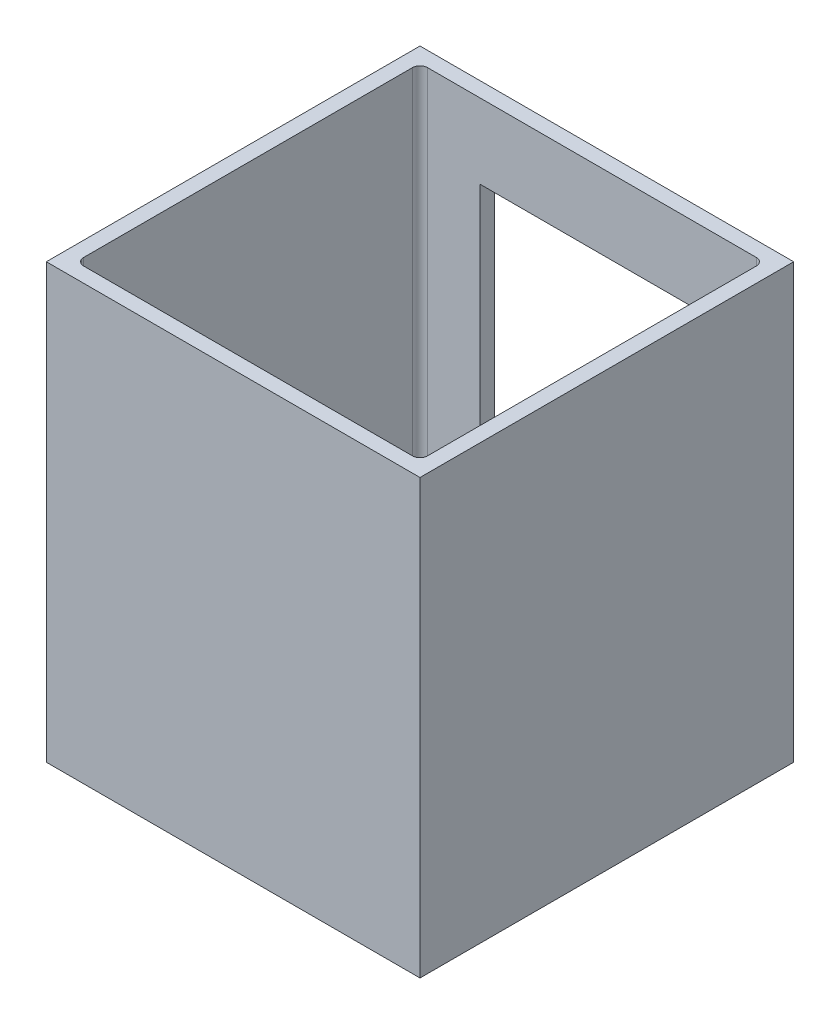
ISO-10303-21;
HEADER;
FILE_DESCRIPTION(('STEP AP214'),'2;1');
FILE_NAME('part.step','',(''),(''),'','','');
FILE_SCHEMA(('AUTOMOTIVE_DESIGN { 1 0 10303 214 1 1 1 1 }'));
ENDSEC;
DATA;
#1=APPLICATION_CONTEXT('core data for automotive mechanical design processes');
#2=APPLICATION_PROTOCOL_DEFINITION('international standard','automotive_design',2000,#1);
#3=PRODUCT_CONTEXT('',#1,'mechanical');
#4=PRODUCT('Part','Part','',(#3));
#5=PRODUCT_RELATED_PRODUCT_CATEGORY('part','',(#4));
#6=PRODUCT_DEFINITION_FORMATION('','',#4);
#7=PRODUCT_DEFINITION_CONTEXT('part definition',#1,'design');
#8=PRODUCT_DEFINITION('design','',#6,#7);
#9=PRODUCT_DEFINITION_SHAPE('','',#8);
#10=(LENGTH_UNIT() NAMED_UNIT(*) SI_UNIT(.MILLI.,.METRE.));
#11=(NAMED_UNIT(*) PLANE_ANGLE_UNIT() SI_UNIT($,.RADIAN.));
#12=(NAMED_UNIT(*) SI_UNIT($,.STERADIAN.) SOLID_ANGLE_UNIT());
#13=UNCERTAINTY_MEASURE_WITH_UNIT(LENGTH_MEASURE(1.E-05),#10,'distance_accuracy_value','');
#14=(GEOMETRIC_REPRESENTATION_CONTEXT(3) GLOBAL_UNCERTAINTY_ASSIGNED_CONTEXT((#13)) GLOBAL_UNIT_ASSIGNED_CONTEXT((#10,
#11,#12)) REPRESENTATION_CONTEXT('',''));
#15=CARTESIAN_POINT('',(0.,0.,0.));
#16=DIRECTION('',(0.,0.,1.));
#17=DIRECTION('',(1.,0.,0.));
#18=AXIS2_PLACEMENT_3D('',#15,#16,#17);
#19=CARTESIAN_POINT('',(2.54,-302.26,0.));
#20=DIRECTION('',(1.,0.,0.));
#21=DIRECTION('',(0.,0.,-1.));
#22=AXIS2_PLACEMENT_3D('',#19,#20,#21);
#23=PLANE('',#22);
#24=DIRECTION('',(0.,0.,1.));
#25=VECTOR('',#24,1.);
#26=CARTESIAN_POINT('',(2.54,-76.2,0.));
#27=LINE('',#26,#25);
#28=CARTESIAN_POINT('',(2.54,-76.2,-55.88));
#29=VERTEX_POINT('',#28);
#30=CARTESIAN_POINT('',(2.54,-76.2,-7.62));
#31=VERTEX_POINT('',#30);
#32=EDGE_CURVE('E434',#29,#31,#27,.T.);
#33=ORIENTED_EDGE('',*,*,#32,.F.);
#34=DIRECTION('',(0.,-1.,0.));
#35=VECTOR('',#34,1.);
#36=CARTESIAN_POINT('',(2.54,-72.39,-55.88));
#37=LINE('',#36,#35);
#38=CARTESIAN_POINT('',(2.54,-72.39,-55.88));
#39=VERTEX_POINT('',#38);
#40=EDGE_CURVE('E280',#39,#29,#37,.T.);
#41=ORIENTED_EDGE('',*,*,#40,.F.);
#42=DIRECTION('',(0.,0.,1.));
#43=VECTOR('',#42,1.);
#44=CARTESIAN_POINT('',(2.54,-72.39,0.));
#45=LINE('',#44,#43);
#46=CARTESIAN_POINT('',(2.54,-72.39,-59.69));
#47=VERTEX_POINT('',#46);
#48=EDGE_CURVE('E267',#47,#39,#45,.T.);
#49=ORIENTED_EDGE('',*,*,#48,.F.);
#50=DIRECTION('',(0.,1.,0.));
#51=VECTOR('',#50,1.);
#52=CARTESIAN_POINT('',(2.54,-2.53999999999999,-59.69));
#53=LINE('',#52,#51);
#54=CARTESIAN_POINT('',(2.54,-2.53999999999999,-59.69));
#55=VERTEX_POINT('',#54);
#56=EDGE_CURVE('E529',#47,#55,#53,.T.);
#57=ORIENTED_EDGE('',*,*,#56,.T.);
#58=DIRECTION('',(0.,0.,-1.));
#59=VECTOR('',#58,1.);
#60=CARTESIAN_POINT('',(2.54,-2.53999999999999,0.));
#61=LINE('',#60,#59);
#62=CARTESIAN_POINT('',(2.54,-2.53999999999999,-3.81));
#63=VERTEX_POINT('',#62);
#64=EDGE_CURVE('E498',#63,#55,#61,.T.);
#65=ORIENTED_EDGE('',*,*,#64,.F.);
#66=DIRECTION('',(0.,1.,0.));
#67=VECTOR('',#66,1.);
#68=CARTESIAN_POINT('',(2.54,-302.26,-3.81));
#69=LINE('',#68,#67);
#70=CARTESIAN_POINT('',(2.54,-72.39,-3.81));
#71=VERTEX_POINT('',#70);
#72=EDGE_CURVE('E532',#63,#71,#69,.F.);
#73=ORIENTED_EDGE('',*,*,#72,.T.);
#74=DIRECTION('',(0.,0.,1.));
#75=VECTOR('',#74,1.);
#76=CARTESIAN_POINT('',(2.54,-72.39,0.));
#77=LINE('',#76,#75);
#78=CARTESIAN_POINT('',(2.54,-72.39,-7.62));
#79=VERTEX_POINT('',#78);
#80=EDGE_CURVE('E386',#79,#71,#77,.T.);
#81=ORIENTED_EDGE('',*,*,#80,.F.);
#82=DIRECTION('',(0.,-1.,0.));
#83=VECTOR('',#82,1.);
#84=CARTESIAN_POINT('',(2.54,-72.39,-7.62));
#85=LINE('',#84,#83);
#86=EDGE_CURVE('E409',#79,#31,#85,.T.);
#87=ORIENTED_EDGE('',*,*,#86,.T.);
#88=EDGE_LOOP('',(#33,#41,#49,#57,#65,#73,#81,#87));
#89=FACE_BOUND('',#88,.T.);
#90=ADVANCED_FACE('F45',(#89),#23,.T.);
#91=CARTESIAN_POINT('',(3.81,-302.26,-59.69));
#92=DIRECTION('',(0.,-1.,0.));
#93=DIRECTION('',(0.,0.,-1.));
#94=AXIS2_PLACEMENT_3D('',#91,#92,#93);
#95=CYLINDRICAL_SURFACE('',#94,1.27);
#96=CARTESIAN_POINT('',(3.81,-72.39,-59.69));
#97=DIRECTION('',(0.,-1.,0.));
#98=DIRECTION('',(0.,0.,-1.));
#99=AXIS2_PLACEMENT_3D('',#96,#97,#98);
#100=CIRCLE('',#99,1.27);
#101=CARTESIAN_POINT('',(3.81,-72.39,-60.96));
#102=VERTEX_POINT('',#101);
#103=EDGE_CURVE('E242',#102,#47,#100,.F.);
#104=ORIENTED_EDGE('',*,*,#103,.F.);
#105=DIRECTION('',(0.,1.,0.));
#106=VECTOR('',#105,1.);
#107=CARTESIAN_POINT('',(3.81,-302.26,-60.96));
#108=LINE('',#107,#106);
#109=CARTESIAN_POINT('',(3.81,-2.53999999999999,-60.96));
#110=VERTEX_POINT('',#109);
#111=EDGE_CURVE('E257',#110,#102,#108,.F.);
#112=ORIENTED_EDGE('',*,*,#111,.F.);
#113=CARTESIAN_POINT('',(3.81,-2.53999999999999,-59.69));
#114=DIRECTION('',(0.,-1.,0.));
#115=DIRECTION('',(0.,0.,-1.));
#116=AXIS2_PLACEMENT_3D('',#113,#114,#115);
#117=CIRCLE('',#116,1.27);
#118=EDGE_CURVE('E551',#55,#110,#117,.T.);
#119=ORIENTED_EDGE('',*,*,#118,.F.);
#120=ORIENTED_EDGE('',*,*,#56,.F.);
#121=EDGE_LOOP('',(#104,#112,#119,#120));
#122=FACE_BOUND('',#121,.T.);
#123=ADVANCED_FACE('F670',(#122),#95,.F.);
#124=CARTESIAN_POINT('',(0.,-302.26,-60.96));
#125=DIRECTION('',(0.,0.,1.));
#126=DIRECTION('',(1.,0.,0.));
#127=AXIS2_PLACEMENT_3D('',#124,#125,#126);
#128=PLANE('',#127);
#129=DIRECTION('',(0.,-1.,0.));
#130=VECTOR('',#129,1.);
#131=CARTESIAN_POINT('',(7.62,-72.39,-60.96));
#132=LINE('',#131,#130);
#133=CARTESIAN_POINT('',(7.62,-72.39,-60.96));
#134=VERTEX_POINT('',#133);
#135=CARTESIAN_POINT('',(7.62,-76.2,-60.96));
#136=VERTEX_POINT('',#135);
#137=EDGE_CURVE('E231',#134,#136,#132,.T.);
#138=ORIENTED_EDGE('',*,*,#137,.T.);
#139=DIRECTION('',(-1.,0.,0.));
#140=VECTOR('',#139,1.);
#141=CARTESIAN_POINT('',(0.,-76.2,-60.96));
#142=LINE('',#141,#140);
#143=CARTESIAN_POINT('',(12.7,-76.2,-60.96));
#144=VERTEX_POINT('',#143);
#145=EDGE_CURVE('E441',#144,#136,#142,.T.);
#146=ORIENTED_EDGE('',*,*,#145,.F.);
#147=DIRECTION('',(0.,-1.,0.));
#148=VECTOR('',#147,1.);
#149=CARTESIAN_POINT('',(12.7,0.,-60.96));
#150=LINE('',#149,#148);
#151=CARTESIAN_POINT('',(12.7,-15.24,-60.96));
#152=VERTEX_POINT('',#151);
#153=EDGE_CURVE('E458',#152,#144,#150,.T.);
#154=ORIENTED_EDGE('',*,*,#153,.F.);
#155=DIRECTION('',(1.,0.,0.));
#156=VECTOR('',#155,1.);
#157=CARTESIAN_POINT('',(0.,-15.24,-60.96));
#158=LINE('',#157,#156);
#159=CARTESIAN_POINT('',(50.8,-15.24,-60.96));
#160=VERTEX_POINT('',#159);
#161=EDGE_CURVE('E449',#152,#160,#158,.T.);
#162=ORIENTED_EDGE('',*,*,#161,.T.);
#163=DIRECTION('',(0.,-1.,0.));
#164=VECTOR('',#163,1.);
#165=CARTESIAN_POINT('',(50.8,0.,-60.96));
#166=LINE('',#165,#164);
#167=CARTESIAN_POINT('',(50.8,-76.2,-60.96));
#168=VERTEX_POINT('',#167);
#169=EDGE_CURVE('E453',#160,#168,#166,.T.);
#170=ORIENTED_EDGE('',*,*,#169,.T.);
#171=CARTESIAN_POINT('',(55.88,-76.2,-60.96));
#172=VERTEX_POINT('',#171);
#173=EDGE_CURVE('E437',#172,#168,#142,.T.);
#174=ORIENTED_EDGE('',*,*,#173,.F.);
#175=DIRECTION('',(0.,-1.,0.));
#176=VECTOR('',#175,1.);
#177=CARTESIAN_POINT('',(55.88,-72.39,-60.96));
#178=LINE('',#177,#176);
#179=CARTESIAN_POINT('',(55.88,-72.39,-60.96));
#180=VERTEX_POINT('',#179);
#181=EDGE_CURVE('E307',#180,#172,#178,.T.);
#182=ORIENTED_EDGE('',*,*,#181,.F.);
#183=DIRECTION('',(-1.,0.,0.));
#184=VECTOR('',#183,1.);
#185=CARTESIAN_POINT('',(0.,-72.39,-60.96));
#186=LINE('',#185,#184);
#187=CARTESIAN_POINT('',(59.69,-72.39,-60.96));
#188=VERTEX_POINT('',#187);
#189=EDGE_CURVE('E294',#188,#180,#186,.T.);
#190=ORIENTED_EDGE('',*,*,#189,.F.);
#191=DIRECTION('',(0.,1.,0.));
#192=VECTOR('',#191,1.);
#193=CARTESIAN_POINT('',(59.69,-302.26,-60.96));
#194=LINE('',#193,#192);
#195=CARTESIAN_POINT('',(59.69,-2.53999999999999,-60.96));
#196=VERTEX_POINT('',#195);
#197=EDGE_CURVE('E536',#188,#196,#194,.T.);
#198=ORIENTED_EDGE('',*,*,#197,.T.);
#199=DIRECTION('',(1.,0.,0.));
#200=VECTOR('',#199,1.);
#201=CARTESIAN_POINT('',(0.,-2.53999999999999,-60.96));
#202=LINE('',#201,#200);
#203=EDGE_CURVE('E494',#110,#196,#202,.T.);
#204=ORIENTED_EDGE('',*,*,#203,.F.);
#205=ORIENTED_EDGE('',*,*,#111,.T.);
#206=DIRECTION('',(-1.,0.,0.));
#207=VECTOR('',#206,1.);
#208=CARTESIAN_POINT('',(0.,-72.39,-60.96));
#209=LINE('',#208,#207);
#210=EDGE_CURVE('E246',#134,#102,#209,.T.);
#211=ORIENTED_EDGE('',*,*,#210,.F.);
#212=EDGE_LOOP('',(#138,#146,#154,#162,#170,#174,#182,#190,#198,#204,#205,#211));
#213=FACE_BOUND('',#212,.T.);
#214=ADVANCED_FACE('F254',(#213),#128,.T.);
#215=CARTESIAN_POINT('',(59.69,-302.26,-59.69));
#216=DIRECTION('',(0.,1.,0.));
#217=DIRECTION('',(0.,0.,1.));
#218=AXIS2_PLACEMENT_3D('',#215,#216,#217);
#219=CYLINDRICAL_SURFACE('',#218,1.27);
#220=CARTESIAN_POINT('',(59.69,-72.39,-59.69));
#221=DIRECTION('',(0.,-1.,0.));
#222=DIRECTION('',(0.,0.,-1.));
#223=AXIS2_PLACEMENT_3D('',#220,#221,#222);
#224=CIRCLE('',#223,1.27);
#225=CARTESIAN_POINT('',(60.96,-72.39,-59.69));
#226=VERTEX_POINT('',#225);
#227=EDGE_CURVE('E297',#226,#188,#224,.F.);
#228=ORIENTED_EDGE('',*,*,#227,.F.);
#229=DIRECTION('',(0.,1.,0.));
#230=VECTOR('',#229,1.);
#231=CARTESIAN_POINT('',(60.96,-302.26,-59.69));
#232=LINE('',#231,#230);
#233=CARTESIAN_POINT('',(60.96,-2.53999999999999,-59.69));
#234=VERTEX_POINT('',#233);
#235=EDGE_CURVE('E544',#234,#226,#232,.F.);
#236=ORIENTED_EDGE('',*,*,#235,.F.);
#237=CARTESIAN_POINT('',(59.69,-2.53999999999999,-59.69));
#238=DIRECTION('',(0.,-1.,0.));
#239=DIRECTION('',(0.,0.,-1.));
#240=AXIS2_PLACEMENT_3D('',#237,#238,#239);
#241=CIRCLE('',#240,1.27);
#242=EDGE_CURVE('E54',#196,#234,#241,.T.);
#243=ORIENTED_EDGE('',*,*,#242,.F.);
#244=ORIENTED_EDGE('',*,*,#197,.F.);
#245=EDGE_LOOP('',(#228,#236,#243,#244));
#246=FACE_BOUND('',#245,.T.);
#247=ADVANCED_FACE('F568',(#246),#219,.F.);
#248=CARTESIAN_POINT('',(60.96,-302.26,0.));
#249=DIRECTION('',(1.,0.,0.));
#250=DIRECTION('',(0.,0.,-1.));
#251=AXIS2_PLACEMENT_3D('',#248,#249,#250);
#252=PLANE('',#251);
#253=DIRECTION('',(0.,0.,-1.));
#254=VECTOR('',#253,1.);
#255=CARTESIAN_POINT('',(60.96,-72.39,0.));
#256=LINE('',#255,#254);
#257=CARTESIAN_POINT('',(60.96,-72.39,-55.88));
#258=VERTEX_POINT('',#257);
#259=EDGE_CURVE('E300',#258,#226,#256,.T.);
#260=ORIENTED_EDGE('',*,*,#259,.F.);
#261=DIRECTION('',(0.,-1.,0.));
#262=VECTOR('',#261,1.);
#263=CARTESIAN_POINT('',(60.96,-72.39,-55.88));
#264=LINE('',#263,#262);
#265=CARTESIAN_POINT('',(60.96,-76.2,-55.88));
#266=VERTEX_POINT('',#265);
#267=EDGE_CURVE('E319',#258,#266,#264,.T.);
#268=ORIENTED_EDGE('',*,*,#267,.T.);
#269=DIRECTION('',(0.,0.,1.));
#270=VECTOR('',#269,1.);
#271=CARTESIAN_POINT('',(60.96,-76.2,0.));
#272=LINE('',#271,#270);
#273=CARTESIAN_POINT('',(60.96,-76.2,-7.62));
#274=VERTEX_POINT('',#273);
#275=EDGE_CURVE('E428',#266,#274,#272,.T.);
#276=ORIENTED_EDGE('',*,*,#275,.T.);
#277=DIRECTION('',(0.,-1.,0.));
#278=VECTOR('',#277,1.);
#279=CARTESIAN_POINT('',(60.96,-72.39,-7.62));
#280=LINE('',#279,#278);
#281=CARTESIAN_POINT('',(60.96,-72.39,-7.62));
#282=VERTEX_POINT('',#281);
#283=EDGE_CURVE('E360',#282,#274,#280,.T.);
#284=ORIENTED_EDGE('',*,*,#283,.F.);
#285=DIRECTION('',(0.,0.,-1.));
#286=VECTOR('',#285,1.);
#287=CARTESIAN_POINT('',(60.96,-72.39,0.));
#288=LINE('',#287,#286);
#289=CARTESIAN_POINT('',(60.96,-72.39,-3.81));
#290=VERTEX_POINT('',#289);
#291=EDGE_CURVE('E341',#290,#282,#288,.T.);
#292=ORIENTED_EDGE('',*,*,#291,.F.);
#293=DIRECTION('',(0.,1.,0.));
#294=VECTOR('',#293,1.);
#295=CARTESIAN_POINT('',(60.96,-2.53999999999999,-3.81));
#296=LINE('',#295,#294);
#297=CARTESIAN_POINT('',(60.96,-2.53999999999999,-3.81));
#298=VERTEX_POINT('',#297);
#299=EDGE_CURVE('E541',#290,#298,#296,.T.);
#300=ORIENTED_EDGE('',*,*,#299,.T.);
#301=DIRECTION('',(0.,0.,-1.));
#302=VECTOR('',#301,1.);
#303=CARTESIAN_POINT('',(60.96,-2.53999999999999,0.));
#304=LINE('',#303,#302);
#305=EDGE_CURVE('E510',#298,#234,#304,.T.);
#306=ORIENTED_EDGE('',*,*,#305,.T.);
#307=ORIENTED_EDGE('',*,*,#235,.T.);
#308=EDGE_LOOP('',(#260,#268,#276,#284,#292,#300,#306,#307));
#309=FACE_BOUND('',#308,.T.);
#310=ADVANCED_FACE('F564',(#309),#252,.F.);
#311=CARTESIAN_POINT('',(59.69,-302.26,-3.81));
#312=DIRECTION('',(0.,-1.,0.));
#313=DIRECTION('',(0.,0.,-1.));
#314=AXIS2_PLACEMENT_3D('',#311,#312,#313);
#315=CYLINDRICAL_SURFACE('',#314,1.27);
#316=CARTESIAN_POINT('',(59.69,-72.39,-3.81));
#317=DIRECTION('',(0.,-1.,0.));
#318=DIRECTION('',(0.,0.,-1.));
#319=AXIS2_PLACEMENT_3D('',#316,#317,#318);
#320=CIRCLE('',#319,1.27);
#321=CARTESIAN_POINT('',(59.69,-72.39,-2.54));
#322=VERTEX_POINT('',#321);
#323=EDGE_CURVE('E345',#322,#290,#320,.F.);
#324=ORIENTED_EDGE('',*,*,#323,.F.);
#325=DIRECTION('',(0.,1.,0.));
#326=VECTOR('',#325,1.);
#327=CARTESIAN_POINT('',(59.69,-302.26,-2.54));
#328=LINE('',#327,#326);
#329=CARTESIAN_POINT('',(59.69,-2.53999999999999,-2.54));
#330=VERTEX_POINT('',#329);
#331=EDGE_CURVE('E522',#330,#322,#328,.F.);
#332=ORIENTED_EDGE('',*,*,#331,.F.);
#333=CARTESIAN_POINT('',(59.69,-2.53999999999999,-3.81));
#334=DIRECTION('',(0.,-1.,0.));
#335=DIRECTION('',(0.,0.,-1.));
#336=AXIS2_PLACEMENT_3D('',#333,#334,#335);
#337=CIRCLE('',#336,1.27);
#338=EDGE_CURVE('E11',#298,#330,#337,.T.);
#339=ORIENTED_EDGE('',*,*,#338,.F.);
#340=ORIENTED_EDGE('',*,*,#299,.F.);
#341=EDGE_LOOP('',(#324,#332,#339,#340));
#342=FACE_BOUND('',#341,.T.);
#343=ADVANCED_FACE('F47',(#342),#315,.F.);
#344=CARTESIAN_POINT('',(0.,-302.26,-2.54));
#345=DIRECTION('',(0.,0.,1.));
#346=DIRECTION('',(1.,0.,0.));
#347=AXIS2_PLACEMENT_3D('',#344,#345,#346);
#348=PLANE('',#347);
#349=DIRECTION('',(1.,0.,0.));
#350=VECTOR('',#349,1.);
#351=CARTESIAN_POINT('',(0.,-72.39,-2.54));
#352=LINE('',#351,#350);
#353=CARTESIAN_POINT('',(55.88,-72.39,-2.54));
#354=VERTEX_POINT('',#353);
#355=EDGE_CURVE('E329',#354,#322,#352,.T.);
#356=ORIENTED_EDGE('',*,*,#355,.F.);
#357=DIRECTION('',(0.,-1.,0.));
#358=VECTOR('',#357,1.);
#359=CARTESIAN_POINT('',(55.88,-72.39,-2.54));
#360=LINE('',#359,#358);
#361=CARTESIAN_POINT('',(55.88,-76.2,-2.54));
#362=VERTEX_POINT('',#361);
#363=EDGE_CURVE('E349',#354,#362,#360,.T.);
#364=ORIENTED_EDGE('',*,*,#363,.T.);
#365=DIRECTION('',(-1.,0.,0.));
#366=VECTOR('',#365,1.);
#367=CARTESIAN_POINT('',(0.,-76.2,-2.54));
#368=LINE('',#367,#366);
#369=CARTESIAN_POINT('',(7.62,-76.2,-2.54));
#370=VERTEX_POINT('',#369);
#371=EDGE_CURVE('E431',#362,#370,#368,.T.);
#372=ORIENTED_EDGE('',*,*,#371,.T.);
#373=DIRECTION('',(0.,-1.,0.));
#374=VECTOR('',#373,1.);
#375=CARTESIAN_POINT('',(7.62,-72.39,-2.54));
#376=LINE('',#375,#374);
#377=CARTESIAN_POINT('',(7.62,-72.39,-2.54));
#378=VERTEX_POINT('',#377);
#379=EDGE_CURVE('E394',#378,#370,#376,.T.);
#380=ORIENTED_EDGE('',*,*,#379,.F.);
#381=DIRECTION('',(1.,0.,0.));
#382=VECTOR('',#381,1.);
#383=CARTESIAN_POINT('',(0.,-72.39,-2.54));
#384=LINE('',#383,#382);
#385=CARTESIAN_POINT('',(3.81,-72.39,-2.54));
#386=VERTEX_POINT('',#385);
#387=EDGE_CURVE('E378',#386,#378,#384,.T.);
#388=ORIENTED_EDGE('',*,*,#387,.F.);
#389=DIRECTION('',(0.,1.,0.));
#390=VECTOR('',#389,1.);
#391=CARTESIAN_POINT('',(3.81,-302.26,-2.54));
#392=LINE('',#391,#390);
#393=CARTESIAN_POINT('',(3.81,-2.53999999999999,-2.54));
#394=VERTEX_POINT('',#393);
#395=EDGE_CURVE('E526',#386,#394,#392,.T.);
#396=ORIENTED_EDGE('',*,*,#395,.T.);
#397=DIRECTION('',(1.,0.,0.));
#398=VECTOR('',#397,1.);
#399=CARTESIAN_POINT('',(0.,-2.53999999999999,-2.54));
#400=LINE('',#399,#398);
#401=EDGE_CURVE('E502',#394,#330,#400,.T.);
#402=ORIENTED_EDGE('',*,*,#401,.T.);
#403=ORIENTED_EDGE('',*,*,#331,.T.);
#404=EDGE_LOOP('',(#356,#364,#372,#380,#388,#396,#402,#403));
#405=FACE_BOUND('',#404,.T.);
#406=ADVANCED_FACE('F596',(#405),#348,.F.);
#407=CARTESIAN_POINT('',(3.81,-302.26,-3.81));
#408=DIRECTION('',(0.,1.,0.));
#409=DIRECTION('',(0.,0.,1.));
#410=AXIS2_PLACEMENT_3D('',#407,#408,#409);
#411=CYLINDRICAL_SURFACE('',#410,1.27);
#412=CARTESIAN_POINT('',(3.81,-72.39,-3.81));
#413=DIRECTION('',(0.,-1.,0.));
#414=DIRECTION('',(0.,0.,-1.));
#415=AXIS2_PLACEMENT_3D('',#412,#413,#414);
#416=CIRCLE('',#415,1.27);
#417=EDGE_CURVE('E382',#71,#386,#416,.F.);
#418=ORIENTED_EDGE('',*,*,#417,.F.);
#419=ORIENTED_EDGE('',*,*,#72,.F.);
#420=CARTESIAN_POINT('',(3.81,-2.53999999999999,-3.81));
#421=DIRECTION('',(0.,-1.,0.));
#422=DIRECTION('',(0.,0.,-1.));
#423=AXIS2_PLACEMENT_3D('',#420,#421,#422);
#424=CIRCLE('',#423,1.27);
#425=EDGE_CURVE('E548',#394,#63,#424,.T.);
#426=ORIENTED_EDGE('',*,*,#425,.F.);
#427=ORIENTED_EDGE('',*,*,#395,.F.);
#428=EDGE_LOOP('',(#418,#419,#426,#427));
#429=FACE_BOUND('',#428,.T.);
#430=ADVANCED_FACE('F608',(#429),#411,.F.);
#431=CARTESIAN_POINT('',(0.,-304.8,0.));
#432=DIRECTION('',(0.,0.,1.));
#433=DIRECTION('',(1.,0.,0.));
#434=AXIS2_PLACEMENT_3D('',#431,#432,#433);
#435=PLANE('',#434);
#436=DIRECTION('',(-1.,0.,0.));
#437=VECTOR('',#436,1.);
#438=CARTESIAN_POINT('',(0.,-76.2,0.));
#439=LINE('',#438,#437);
#440=CARTESIAN_POINT('',(63.5,-76.2,0.));
#441=VERTEX_POINT('',#440);
#442=CARTESIAN_POINT('',(0.,-76.2,0.));
#443=VERTEX_POINT('',#442);
#444=EDGE_CURVE('E425',#441,#443,#439,.T.);
#445=ORIENTED_EDGE('',*,*,#444,.F.);
#446=DIRECTION('',(0.,1.,0.));
#447=VECTOR('',#446,1.);
#448=CARTESIAN_POINT('',(63.5,-304.8,0.));
#449=LINE('',#448,#447);
#450=CARTESIAN_POINT('',(63.5,-2.54,0.));
#451=VERTEX_POINT('',#450);
#452=EDGE_CURVE('E514',#441,#451,#449,.T.);
#453=ORIENTED_EDGE('',*,*,#452,.T.);
#454=DIRECTION('',(1.,0.,0.));
#455=VECTOR('',#454,1.);
#456=CARTESIAN_POINT('',(0.,-2.54,0.));
#457=LINE('',#456,#455);
#458=CARTESIAN_POINT('',(0.,-2.5400000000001,0.));
#459=VERTEX_POINT('',#458);
#460=EDGE_CURVE('E482',#459,#451,#457,.T.);
#461=ORIENTED_EDGE('',*,*,#460,.F.);
#462=DIRECTION('',(0.,1.,0.));
#463=VECTOR('',#462,1.);
#464=CARTESIAN_POINT('',(0.,-304.8,0.));
#465=LINE('',#464,#463);
#466=EDGE_CURVE('E506',#443,#459,#465,.T.);
#467=ORIENTED_EDGE('',*,*,#466,.F.);
#468=EDGE_LOOP('',(#445,#453,#461,#467));
#469=FACE_BOUND('',#468,.T.);
#470=ADVANCED_FACE('F648',(#469),#435,.T.);
#471=CARTESIAN_POINT('',(0.,-304.8,0.));
#472=DIRECTION('',(-1.,0.,0.));
#473=DIRECTION('',(0.,0.,1.));
#474=AXIS2_PLACEMENT_3D('',#471,#472,#473);
#475=PLANE('',#474);
#476=DIRECTION('',(0.,0.,-1.));
#477=VECTOR('',#476,1.);
#478=CARTESIAN_POINT('',(0.,-76.2,-63.5));
#479=LINE('',#478,#477);
#480=CARTESIAN_POINT('',(0.,-76.2,-63.5));
#481=VERTEX_POINT('',#480);
#482=EDGE_CURVE('E408',#443,#481,#479,.T.);
#483=ORIENTED_EDGE('',*,*,#482,.F.);
#484=ORIENTED_EDGE('',*,*,#466,.T.);
#485=DIRECTION('',(0.,0.,1.));
#486=VECTOR('',#485,1.);
#487=CARTESIAN_POINT('',(0.,-2.54,0.));
#488=LINE('',#487,#486);
#489=CARTESIAN_POINT('',(0.,-2.54,-63.5));
#490=VERTEX_POINT('',#489);
#491=EDGE_CURVE('E475',#490,#459,#488,.T.);
#492=ORIENTED_EDGE('',*,*,#491,.F.);
#493=DIRECTION('',(0.,1.,0.));
#494=VECTOR('',#493,1.);
#495=CARTESIAN_POINT('',(0.,-304.8,-63.5));
#496=LINE('',#495,#494);
#497=EDGE_CURVE('E507',#481,#490,#496,.T.);
#498=ORIENTED_EDGE('',*,*,#497,.F.);
#499=EDGE_LOOP('',(#483,#484,#492,#498));
#500=FACE_BOUND('',#499,.T.);
#501=ADVANCED_FACE('F645',(#500),#475,.T.);
#502=CARTESIAN_POINT('',(0.,-304.8,-63.5));
#503=DIRECTION('',(0.,0.,-1.));
#504=DIRECTION('',(-1.,0.,0.));
#505=AXIS2_PLACEMENT_3D('',#502,#503,#504);
#506=PLANE('',#505);
#507=DIRECTION('',(1.,0.,0.));
#508=VECTOR('',#507,1.);
#509=CARTESIAN_POINT('',(0.,-76.2,-63.5));
#510=LINE('',#509,#508);
#511=CARTESIAN_POINT('',(12.7,-76.2,-63.5));
#512=VERTEX_POINT('',#511);
#513=EDGE_CURVE('E419',#481,#512,#510,.T.);
#514=ORIENTED_EDGE('',*,*,#513,.F.);
#515=ORIENTED_EDGE('',*,*,#497,.T.);
#516=DIRECTION('',(-1.,0.,0.));
#517=VECTOR('',#516,1.);
#518=CARTESIAN_POINT('',(0.,-2.54,-63.5));
#519=LINE('',#518,#517);
#520=CARTESIAN_POINT('',(63.5,-2.54,-63.5));
#521=VERTEX_POINT('',#520);
#522=EDGE_CURVE('E490',#521,#490,#519,.T.);
#523=ORIENTED_EDGE('',*,*,#522,.F.);
#524=DIRECTION('',(0.,1.,0.));
#525=VECTOR('',#524,1.);
#526=CARTESIAN_POINT('',(63.5,-304.8,-63.5));
#527=LINE('',#526,#525);
#528=CARTESIAN_POINT('',(63.5,-76.2,-63.5));
#529=VERTEX_POINT('',#528);
#530=EDGE_CURVE('E511',#529,#521,#527,.T.);
#531=ORIENTED_EDGE('',*,*,#530,.F.);
#532=CARTESIAN_POINT('',(50.8,-76.2,-63.5));
#533=VERTEX_POINT('',#532);
#534=EDGE_CURVE('E418',#533,#529,#510,.T.);
#535=ORIENTED_EDGE('',*,*,#534,.F.);
#536=DIRECTION('',(0.,-1.,0.));
#537=VECTOR('',#536,1.);
#538=CARTESIAN_POINT('',(50.8,0.,-63.5));
#539=LINE('',#538,#537);
#540=CARTESIAN_POINT('',(50.8,-15.24,-63.5));
#541=VERTEX_POINT('',#540);
#542=EDGE_CURVE('E465',#541,#533,#539,.T.);
#543=ORIENTED_EDGE('',*,*,#542,.F.);
#544=DIRECTION('',(1.,0.,0.));
#545=VECTOR('',#544,1.);
#546=CARTESIAN_POINT('',(0.,-15.24,-63.5));
#547=LINE('',#546,#545);
#548=CARTESIAN_POINT('',(12.7,-15.24,-63.5));
#549=VERTEX_POINT('',#548);
#550=EDGE_CURVE('E448',#549,#541,#547,.T.);
#551=ORIENTED_EDGE('',*,*,#550,.F.);
#552=DIRECTION('',(0.,-1.,0.));
#553=VECTOR('',#552,1.);
#554=CARTESIAN_POINT('',(12.7,0.,-63.5));
#555=LINE('',#554,#553);
#556=EDGE_CURVE('E454',#549,#512,#555,.T.);
#557=ORIENTED_EDGE('',*,*,#556,.T.);
#558=EDGE_LOOP('',(#514,#515,#523,#531,#535,#543,#551,#557));
#559=FACE_BOUND('',#558,.T.);
#560=ADVANCED_FACE('F638',(#559),#506,.T.);
#561=CARTESIAN_POINT('',(63.5,-304.8,0.));
#562=DIRECTION('',(1.,0.,0.));
#563=DIRECTION('',(0.,0.,-1.));
#564=AXIS2_PLACEMENT_3D('',#561,#562,#563);
#565=PLANE('',#564);
#566=DIRECTION('',(0.,0.,1.));
#567=VECTOR('',#566,1.);
#568=CARTESIAN_POINT('',(63.5,-76.2,-63.5));
#569=LINE('',#568,#567);
#570=EDGE_CURVE('E422',#529,#441,#569,.T.);
#571=ORIENTED_EDGE('',*,*,#570,.F.);
#572=ORIENTED_EDGE('',*,*,#530,.T.);
#573=DIRECTION('',(0.,0.,-1.));
#574=VECTOR('',#573,1.);
#575=CARTESIAN_POINT('',(63.5,-2.54,0.));
#576=LINE('',#575,#574);
#577=EDGE_CURVE('E486',#451,#521,#576,.T.);
#578=ORIENTED_EDGE('',*,*,#577,.F.);
#579=ORIENTED_EDGE('',*,*,#452,.F.);
#580=EDGE_LOOP('',(#571,#572,#578,#579));
#581=FACE_BOUND('',#580,.T.);
#582=ADVANCED_FACE('F634',(#581),#565,.T.);
#583=CARTESIAN_POINT('',(0.,-2.54,0.));
#584=DIRECTION('',(0.,-1.,0.));
#585=DIRECTION('',(0.,0.,-1.));
#586=AXIS2_PLACEMENT_3D('',#583,#584,#585);
#587=PLANE('',#586);
#588=ORIENTED_EDGE('',*,*,#491,.T.);
#589=ORIENTED_EDGE('',*,*,#460,.T.);
#590=ORIENTED_EDGE('',*,*,#577,.T.);
#591=ORIENTED_EDGE('',*,*,#522,.T.);
#592=EDGE_LOOP('',(#588,#589,#590,#591));
#593=FACE_BOUND('',#592,.T.);
#594=ORIENTED_EDGE('',*,*,#401,.F.);
#595=ORIENTED_EDGE('',*,*,#425,.T.);
#596=ORIENTED_EDGE('',*,*,#64,.T.);
#597=ORIENTED_EDGE('',*,*,#118,.T.);
#598=ORIENTED_EDGE('',*,*,#203,.T.);
#599=ORIENTED_EDGE('',*,*,#242,.T.);
#600=ORIENTED_EDGE('',*,*,#305,.F.);
#601=ORIENTED_EDGE('',*,*,#338,.T.);
#602=EDGE_LOOP('',(#594,#595,#596,#597,#598,#599,#600,#601));
#603=FACE_BOUND('',#602,.T.);
#604=ADVANCED_FACE('F558',(#593,#603),#587,.F.);
#605=CARTESIAN_POINT('',(0.,-15.24,-60.96));
#606=DIRECTION('',(0.,1.,0.));
#607=DIRECTION('',(0.,0.,1.));
#608=AXIS2_PLACEMENT_3D('',#605,#606,#607);
#609=PLANE('',#608);
#610=ORIENTED_EDGE('',*,*,#550,.T.);
#611=DIRECTION('',(0.,0.,-1.));
#612=VECTOR('',#611,1.);
#613=CARTESIAN_POINT('',(50.8,-15.24,-60.96));
#614=LINE('',#613,#612);
#615=EDGE_CURVE('E462',#160,#541,#614,.T.);
#616=ORIENTED_EDGE('',*,*,#615,.F.);
#617=ORIENTED_EDGE('',*,*,#161,.F.);
#618=DIRECTION('',(0.,0.,-1.));
#619=VECTOR('',#618,1.);
#620=CARTESIAN_POINT('',(12.7,-15.24,-60.96));
#621=LINE('',#620,#619);
#622=EDGE_CURVE('E472',#152,#549,#621,.T.);
#623=ORIENTED_EDGE('',*,*,#622,.T.);
#624=EDGE_LOOP('',(#610,#616,#617,#623));
#625=FACE_BOUND('',#624,.T.);
#626=ADVANCED_FACE('F656',(#625),#609,.F.);
#627=CARTESIAN_POINT('',(12.7,0.,-60.96));
#628=DIRECTION('',(1.,0.,0.));
#629=DIRECTION('',(0.,0.,-1.));
#630=AXIS2_PLACEMENT_3D('',#627,#628,#629);
#631=PLANE('',#630);
#632=DIRECTION('',(0.,0.,1.));
#633=VECTOR('',#632,1.);
#634=CARTESIAN_POINT('',(12.7,-76.2,-60.96));
#635=LINE('',#634,#633);
#636=EDGE_CURVE('E445',#512,#144,#635,.T.);
#637=ORIENTED_EDGE('',*,*,#636,.F.);
#638=ORIENTED_EDGE('',*,*,#556,.F.);
#639=ORIENTED_EDGE('',*,*,#622,.F.);
#640=ORIENTED_EDGE('',*,*,#153,.T.);
#641=EDGE_LOOP('',(#637,#638,#639,#640));
#642=FACE_BOUND('',#641,.T.);
#643=ADVANCED_FACE('F652',(#642),#631,.T.);
#644=CARTESIAN_POINT('',(50.8,0.,-60.96));
#645=DIRECTION('',(1.,0.,0.));
#646=DIRECTION('',(0.,0.,-1.));
#647=AXIS2_PLACEMENT_3D('',#644,#645,#646);
#648=PLANE('',#647);
#649=ORIENTED_EDGE('',*,*,#542,.T.);
#650=DIRECTION('',(0.,0.,1.));
#651=VECTOR('',#650,1.);
#652=CARTESIAN_POINT('',(50.8,-76.2,-60.96));
#653=LINE('',#652,#651);
#654=EDGE_CURVE('E440',#533,#168,#653,.T.);
#655=ORIENTED_EDGE('',*,*,#654,.T.);
#656=ORIENTED_EDGE('',*,*,#169,.F.);
#657=ORIENTED_EDGE('',*,*,#615,.T.);
#658=EDGE_LOOP('',(#649,#655,#656,#657));
#659=FACE_BOUND('',#658,.T.);
#660=ADVANCED_FACE('F658',(#659),#648,.F.);
#661=CARTESIAN_POINT('',(0.,-76.2,0.));
#662=DIRECTION('',(0.,1.,0.));
#663=DIRECTION('',(0.,0.,1.));
#664=AXIS2_PLACEMENT_3D('',#661,#662,#663);
#665=PLANE('',#664);
#666=ORIENTED_EDGE('',*,*,#145,.T.);
#667=DIRECTION('',(0.,0.,1.));
#668=VECTOR('',#667,1.);
#669=CARTESIAN_POINT('',(7.62,-76.2,0.));
#670=LINE('',#669,#668);
#671=CARTESIAN_POINT('',(7.62,-76.2,-55.88));
#672=VERTEX_POINT('',#671);
#673=EDGE_CURVE('E235',#136,#672,#670,.T.);
#674=ORIENTED_EDGE('',*,*,#673,.T.);
#675=DIRECTION('',(1.,0.,0.));
#676=VECTOR('',#675,1.);
#677=CARTESIAN_POINT('',(0.,-76.2,-55.88));
#678=LINE('',#677,#676);
#679=EDGE_CURVE('E61',#29,#672,#678,.T.);
#680=ORIENTED_EDGE('',*,*,#679,.F.);
#681=ORIENTED_EDGE('',*,*,#32,.T.);
#682=DIRECTION('',(1.,0.,0.));
#683=VECTOR('',#682,1.);
#684=CARTESIAN_POINT('',(0.,-76.2,-7.62));
#685=LINE('',#684,#683);
#686=CARTESIAN_POINT('',(7.62,-76.2,-7.62));
#687=VERTEX_POINT('',#686);
#688=EDGE_CURVE('E375',#31,#687,#685,.T.);
#689=ORIENTED_EDGE('',*,*,#688,.T.);
#690=DIRECTION('',(0.,0.,-1.));
#691=VECTOR('',#690,1.);
#692=CARTESIAN_POINT('',(7.62,-76.2,0.));
#693=LINE('',#692,#691);
#694=EDGE_CURVE('E398',#370,#687,#693,.T.);
#695=ORIENTED_EDGE('',*,*,#694,.F.);
#696=ORIENTED_EDGE('',*,*,#371,.F.);
#697=DIRECTION('',(0.,0.,-1.));
#698=VECTOR('',#697,1.);
#699=CARTESIAN_POINT('',(55.88,-76.2,0.));
#700=LINE('',#699,#698);
#701=CARTESIAN_POINT('',(55.88,-76.2,-7.62));
#702=VERTEX_POINT('',#701);
#703=EDGE_CURVE('E353',#362,#702,#700,.T.);
#704=ORIENTED_EDGE('',*,*,#703,.T.);
#705=DIRECTION('',(-1.,0.,0.));
#706=VECTOR('',#705,1.);
#707=CARTESIAN_POINT('',(0.,-76.2,-7.62));
#708=LINE('',#707,#706);
#709=EDGE_CURVE('E330',#274,#702,#708,.T.);
#710=ORIENTED_EDGE('',*,*,#709,.F.);
#711=ORIENTED_EDGE('',*,*,#275,.F.);
#712=DIRECTION('',(-1.,0.,0.));
#713=VECTOR('',#712,1.);
#714=CARTESIAN_POINT('',(0.,-76.2,-55.88));
#715=LINE('',#714,#713);
#716=CARTESIAN_POINT('',(55.88,-76.2,-55.88));
#717=VERTEX_POINT('',#716);
#718=EDGE_CURVE('E291',#266,#717,#715,.T.);
#719=ORIENTED_EDGE('',*,*,#718,.T.);
#720=DIRECTION('',(0.,0.,1.));
#721=VECTOR('',#720,1.);
#722=CARTESIAN_POINT('',(55.88,-76.2,0.));
#723=LINE('',#722,#721);
#724=EDGE_CURVE('E68',#172,#717,#723,.T.);
#725=ORIENTED_EDGE('',*,*,#724,.F.);
#726=ORIENTED_EDGE('',*,*,#173,.T.);
#727=ORIENTED_EDGE('',*,*,#654,.F.);
#728=ORIENTED_EDGE('',*,*,#534,.T.);
#729=ORIENTED_EDGE('',*,*,#570,.T.);
#730=ORIENTED_EDGE('',*,*,#444,.T.);
#731=ORIENTED_EDGE('',*,*,#482,.T.);
#732=ORIENTED_EDGE('',*,*,#513,.T.);
#733=ORIENTED_EDGE('',*,*,#636,.T.);
#734=EDGE_LOOP('',(#666,#674,#680,#681,#689,#695,#696,#704,#710,#711,#719,#725,#726,#727,#728,
#729,#730,#731,#732,#733));
#735=FACE_BOUND('',#734,.T.);
#736=CARTESIAN_POINT('',(5.08,-76.2,-5.08));
#737=DIRECTION('',(0.,-1.,0.));
#738=DIRECTION('',(0.,0.,-1.));
#739=AXIS2_PLACEMENT_3D('',#736,#737,#738);
#740=CIRCLE('',#739,1.651);
#741=CARTESIAN_POINT('',(5.08,-76.2,-6.731));
#742=VERTEX_POINT('',#741);
#743=EDGE_CURVE('E364',#742,#742,#740,.T.);
#744=ORIENTED_EDGE('',*,*,#743,.F.);
#745=EDGE_LOOP('',(#744));
#746=FACE_BOUND('',#745,.T.);
#747=CARTESIAN_POINT('',(58.42,-76.2,-5.08));
#748=DIRECTION('',(0.,-1.,0.));
#749=DIRECTION('',(0.,0.,-1.));
#750=AXIS2_PLACEMENT_3D('',#747,#748,#749);
#751=CIRCLE('',#750,1.651);
#752=CARTESIAN_POINT('',(58.42,-76.2,-6.731));
#753=VERTEX_POINT('',#752);
#754=EDGE_CURVE('E318',#753,#753,#751,.T.);
#755=ORIENTED_EDGE('',*,*,#754,.F.);
#756=EDGE_LOOP('',(#755));
#757=FACE_BOUND('',#756,.T.);
#758=CARTESIAN_POINT('',(58.42,-76.2,-58.42));
#759=DIRECTION('',(0.,-1.,0.));
#760=DIRECTION('',(0.,0.,-1.));
#761=AXIS2_PLACEMENT_3D('',#758,#759,#760);
#762=CIRCLE('',#761,1.651);
#763=CARTESIAN_POINT('',(58.42,-76.2,-60.071));
#764=VERTEX_POINT('',#763);
#765=EDGE_CURVE('E283',#764,#764,#762,.T.);
#766=ORIENTED_EDGE('',*,*,#765,.F.);
#767=EDGE_LOOP('',(#766));
#768=FACE_BOUND('',#767,.T.);
#769=CARTESIAN_POINT('',(5.08,-76.2,-58.42));
#770=DIRECTION('',(0.,-1.,0.));
#771=DIRECTION('',(0.,0.,-1.));
#772=AXIS2_PLACEMENT_3D('',#769,#770,#771);
#773=CIRCLE('',#772,1.651);
#774=CARTESIAN_POINT('',(5.08,-76.2,-60.071));
#775=VERTEX_POINT('',#774);
#776=EDGE_CURVE('E272',#775,#775,#773,.T.);
#777=ORIENTED_EDGE('',*,*,#776,.F.);
#778=EDGE_LOOP('',(#777));
#779=FACE_BOUND('',#778,.T.);
#780=ADVANCED_FACE('F582',(#735,#746,#757,#768,#779),#665,.F.);
#781=CARTESIAN_POINT('',(7.62,-72.39,0.));
#782=DIRECTION('',(-1.,0.,0.));
#783=DIRECTION('',(0.,0.,1.));
#784=AXIS2_PLACEMENT_3D('',#781,#782,#783);
#785=PLANE('',#784);
#786=ORIENTED_EDGE('',*,*,#694,.T.);
#787=DIRECTION('',(0.,-1.,0.));
#788=VECTOR('',#787,1.);
#789=CARTESIAN_POINT('',(7.62,-72.39,-7.62));
#790=LINE('',#789,#788);
#791=CARTESIAN_POINT('',(7.62,-72.39,-7.62));
#792=VERTEX_POINT('',#791);
#793=EDGE_CURVE('E405',#792,#687,#790,.T.);
#794=ORIENTED_EDGE('',*,*,#793,.F.);
#795=DIRECTION('',(0.,0.,-1.));
#796=VECTOR('',#795,1.);
#797=CARTESIAN_POINT('',(7.62,-72.39,0.));
#798=LINE('',#797,#796);
#799=EDGE_CURVE('E374',#378,#792,#798,.T.);
#800=ORIENTED_EDGE('',*,*,#799,.F.);
#801=ORIENTED_EDGE('',*,*,#379,.T.);
#802=EDGE_LOOP('',(#786,#794,#800,#801));
#803=FACE_BOUND('',#802,.T.);
#804=ADVANCED_FACE('F666',(#803),#785,.F.);
#805=CARTESIAN_POINT('',(0.,-72.39,-7.62));
#806=DIRECTION('',(0.,0.,-1.));
#807=DIRECTION('',(-1.,0.,0.));
#808=AXIS2_PLACEMENT_3D('',#805,#806,#807);
#809=PLANE('',#808);
#810=ORIENTED_EDGE('',*,*,#688,.F.);
#811=ORIENTED_EDGE('',*,*,#86,.F.);
#812=DIRECTION('',(1.,0.,0.));
#813=VECTOR('',#812,1.);
#814=CARTESIAN_POINT('',(0.,-72.39,-7.62));
#815=LINE('',#814,#813);
#816=EDGE_CURVE('E390',#79,#792,#815,.T.);
#817=ORIENTED_EDGE('',*,*,#816,.T.);
#818=ORIENTED_EDGE('',*,*,#793,.T.);
#819=EDGE_LOOP('',(#810,#811,#817,#818));
#820=FACE_BOUND('',#819,.T.);
#821=ADVANCED_FACE('F616',(#820),#809,.T.);
#822=CARTESIAN_POINT('',(5.08,-72.39,-5.08));
#823=DIRECTION('',(0.,-1.,0.));
#824=DIRECTION('',(0.,0.,-1.));
#825=AXIS2_PLACEMENT_3D('',#822,#823,#824);
#826=CYLINDRICAL_SURFACE('',#825,1.651);
#827=CARTESIAN_POINT('',(5.08,-72.39,-5.08));
#828=DIRECTION('',(0.,-1.,0.));
#829=DIRECTION('',(0.,0.,-1.));
#830=AXIS2_PLACEMENT_3D('',#827,#828,#829);
#831=CIRCLE('',#830,1.651);
#832=CARTESIAN_POINT('',(5.08,-72.39,-6.731));
#833=VERTEX_POINT('',#832);
#834=EDGE_CURVE('E370',#833,#833,#831,.T.);
#835=CARTESIAN_POINT('',(5.08,-72.39,-6.731));
#836=CARTESIAN_POINT('',(5.08,-72.4296875,-6.731));
#837=CARTESIAN_POINT('',(5.08,-72.469375,-6.731));
#838=CARTESIAN_POINT('',(5.08,-72.54875,-6.731));
#839=CARTESIAN_POINT('',(5.08,-72.5884375,-6.731));
#840=CARTESIAN_POINT('',(5.08,-72.6678125,-6.731));
#841=CARTESIAN_POINT('',(5.08,-72.7075,-6.731));
#842=CARTESIAN_POINT('',(5.08,-72.786875,-6.731));
#843=CARTESIAN_POINT('',(5.08,-72.8265625,-6.731));
#844=CARTESIAN_POINT('',(5.08,-72.9059375,-6.731));
#845=CARTESIAN_POINT('',(5.08,-72.945625,-6.731));
#846=CARTESIAN_POINT('',(5.08,-73.025,-6.731));
#847=CARTESIAN_POINT('',(5.08,-73.0646875,-6.731));
#848=CARTESIAN_POINT('',(5.08,-73.1440625,-6.731));
#849=CARTESIAN_POINT('',(5.08,-73.18375,-6.731));
#850=CARTESIAN_POINT('',(5.08,-73.263125,-6.731));
#851=CARTESIAN_POINT('',(5.08,-73.3028125,-6.731));
#852=CARTESIAN_POINT('',(5.08,-73.3821875,-6.731));
#853=CARTESIAN_POINT('',(5.08,-73.421875,-6.731));
#854=CARTESIAN_POINT('',(5.08,-73.50125,-6.731));
#855=CARTESIAN_POINT('',(5.08,-73.5409375,-6.731));
#856=CARTESIAN_POINT('',(5.08,-73.6203125,-6.731));
#857=CARTESIAN_POINT('',(5.08,-73.66,-6.731));
#858=CARTESIAN_POINT('',(5.08,-73.739375,-6.731));
#859=CARTESIAN_POINT('',(5.08,-73.7790625,-6.731));
#860=CARTESIAN_POINT('',(5.08,-73.8584375,-6.731));
#861=CARTESIAN_POINT('',(5.08,-73.898125,-6.731));
#862=CARTESIAN_POINT('',(5.08,-73.9775,-6.731));
#863=CARTESIAN_POINT('',(5.08,-74.0171875,-6.731));
#864=CARTESIAN_POINT('',(5.08,-74.0965625,-6.731));
#865=CARTESIAN_POINT('',(5.08,-74.13625,-6.731));
#866=CARTESIAN_POINT('',(5.08,-74.215625,-6.731));
#867=CARTESIAN_POINT('',(5.08,-74.2553125,-6.731));
#868=CARTESIAN_POINT('',(5.08,-74.3346875,-6.731));
#869=CARTESIAN_POINT('',(5.08,-74.374375,-6.731));
#870=CARTESIAN_POINT('',(5.08,-74.45375,-6.731));
#871=CARTESIAN_POINT('',(5.08,-74.4934375,-6.731));
#872=CARTESIAN_POINT('',(5.08,-74.5728125,-6.731));
#873=CARTESIAN_POINT('',(5.08,-74.6125,-6.731));
#874=CARTESIAN_POINT('',(5.08,-74.691875,-6.731));
#875=CARTESIAN_POINT('',(5.08,-74.7315625,-6.731));
#876=CARTESIAN_POINT('',(5.08,-74.8109375,-6.731));
#877=CARTESIAN_POINT('',(5.08,-74.850625,-6.731));
#878=CARTESIAN_POINT('',(5.08,-74.93,-6.731));
#879=CARTESIAN_POINT('',(5.08,-74.9696875,-6.731));
#880=CARTESIAN_POINT('',(5.08,-75.0490625,-6.731));
#881=CARTESIAN_POINT('',(5.08,-75.08875,-6.731));
#882=CARTESIAN_POINT('',(5.08,-75.168125,-6.731));
#883=CARTESIAN_POINT('',(5.08,-75.2078125,-6.731));
#884=CARTESIAN_POINT('',(5.08,-75.2871875,-6.731));
#885=CARTESIAN_POINT('',(5.08,-75.326875,-6.731));
#886=CARTESIAN_POINT('',(5.08,-75.40625,-6.731));
#887=CARTESIAN_POINT('',(5.08,-75.4459375,-6.731));
#888=CARTESIAN_POINT('',(5.08,-75.5253125,-6.731));
#889=CARTESIAN_POINT('',(5.08,-75.565,-6.731));
#890=CARTESIAN_POINT('',(5.08,-75.644375,-6.731));
#891=CARTESIAN_POINT('',(5.08,-75.6840625,-6.731));
#892=CARTESIAN_POINT('',(5.08,-75.7634375,-6.731));
#893=CARTESIAN_POINT('',(5.08,-75.803125,-6.731));
#894=CARTESIAN_POINT('',(5.08,-75.8825,-6.731));
#895=CARTESIAN_POINT('',(5.08,-75.9221875,-6.731));
#896=CARTESIAN_POINT('',(5.08,-76.0015625,-6.731));
#897=CARTESIAN_POINT('',(5.08,-76.04125,-6.731));
#898=CARTESIAN_POINT('',(5.08,-76.120625,-6.731));
#899=CARTESIAN_POINT('',(5.08,-76.1603125,-6.731));
#900=CARTESIAN_POINT('',(5.08,-76.2,-6.731));
#901=B_SPLINE_CURVE_WITH_KNOTS('',3,(#835,#836,#837,#838,#839,#840,#841,#842,#843,#844,#845,
#846,#847,#848,#849,#850,#851,#852,#853,#854,#855,#856,#857,#858,#859,#860,#861,#862,#863,#864,
#865,#866,#867,#868,#869,#870,#871,#872,#873,#874,#875,#876,#877,#878,#879,#880,#881,#882,#883,
#884,#885,#886,#887,#888,#889,#890,#891,#892,#893,#894,#895,#896,#897,#898,#899,#900),
.UNSPECIFIED.,.F.,.F.,(4,2,2,2,2,2,2,2,2,2,2,2,2,2,2,2,2,2,2,2,2,2,2,2,2,2,2,2,2,2,2,2,4),(0.,
0.119062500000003,0.238125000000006,0.357187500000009,0.476250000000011,0.5953125,
0.714375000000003,0.833437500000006,0.952500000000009,1.07156250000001,1.190625,1.3096875,
1.42875000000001,1.54781250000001,1.666875,1.7859375,1.905,2.02406250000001,2.14312500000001,
2.2621875,2.38125,2.5003125,2.61937500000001,2.7384375,2.8575,2.9765625,3.095625,
3.21468750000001,3.33375,3.4528125,3.571875,3.6909375,3.80999999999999),.UNSPECIFIED.);
#902=EDGE_CURVE('BSEAM743',#833,#742,#901,.T.);
#903=ORIENTED_EDGE('',*,*,#834,.F.);
#904=ORIENTED_EDGE('',*,*,#743,.T.);
#905=ORIENTED_EDGE('',*,*,#902,.T.);
#906=ORIENTED_EDGE('',*,*,#902,.F.);
#907=EDGE_LOOP('',(#903,#905,#904,#906));
#908=FACE_BOUND('',#907,.T.);
#909=ADVANCED_FACE('F743',(#908),#826,.F.);
#910=CARTESIAN_POINT('',(0.,-72.39,0.));
#911=DIRECTION('',(0.,-1.,0.));
#912=DIRECTION('',(0.,0.,-1.));
#913=AXIS2_PLACEMENT_3D('',#910,#911,#912);
#914=PLANE('',#913);
#915=ORIENTED_EDGE('',*,*,#834,.T.);
#916=EDGE_LOOP('',(#915));
#917=FACE_BOUND('',#916,.T.);
#918=ORIENTED_EDGE('',*,*,#799,.T.);
#919=ORIENTED_EDGE('',*,*,#816,.F.);
#920=ORIENTED_EDGE('',*,*,#80,.T.);
#921=ORIENTED_EDGE('',*,*,#417,.T.);
#922=ORIENTED_EDGE('',*,*,#387,.T.);
#923=EDGE_LOOP('',(#918,#919,#920,#921,#922));
#924=FACE_BOUND('',#923,.T.);
#925=ADVANCED_FACE('F610',(#917,#924),#914,.F.);
#926=CARTESIAN_POINT('',(0.,-72.39,-7.62));
#927=DIRECTION('',(0.,0.,1.));
#928=DIRECTION('',(1.,0.,0.));
#929=AXIS2_PLACEMENT_3D('',#926,#927,#928);
#930=PLANE('',#929);
#931=ORIENTED_EDGE('',*,*,#709,.T.);
#932=DIRECTION('',(0.,-1.,0.));
#933=VECTOR('',#932,1.);
#934=CARTESIAN_POINT('',(55.88,-72.39,-7.62));
#935=LINE('',#934,#933);
#936=CARTESIAN_POINT('',(55.88,-72.39,-7.62));
#937=VERTEX_POINT('',#936);
#938=EDGE_CURVE('E365',#937,#702,#935,.T.);
#939=ORIENTED_EDGE('',*,*,#938,.F.);
#940=DIRECTION('',(-1.,0.,0.));
#941=VECTOR('',#940,1.);
#942=CARTESIAN_POINT('',(0.,-72.39,-7.62));
#943=LINE('',#942,#941);
#944=EDGE_CURVE('E338',#282,#937,#943,.T.);
#945=ORIENTED_EDGE('',*,*,#944,.F.);
#946=ORIENTED_EDGE('',*,*,#283,.T.);
#947=EDGE_LOOP('',(#931,#939,#945,#946));
#948=FACE_BOUND('',#947,.T.);
#949=ADVANCED_FACE('F588',(#948),#930,.F.);
#950=CARTESIAN_POINT('',(58.42,-72.39,-5.08));
#951=DIRECTION('',(0.,-1.,0.));
#952=DIRECTION('',(0.,0.,-1.));
#953=AXIS2_PLACEMENT_3D('',#950,#951,#952);
#954=CYLINDRICAL_SURFACE('',#953,1.651);
#955=CARTESIAN_POINT('',(58.42,-72.39,-5.08));
#956=DIRECTION('',(0.,-1.,0.));
#957=DIRECTION('',(0.,0.,-1.));
#958=AXIS2_PLACEMENT_3D('',#955,#956,#957);
#959=CIRCLE('',#958,1.651);
#960=CARTESIAN_POINT('',(58.42,-72.39,-6.731));
#961=VERTEX_POINT('',#960);
#962=EDGE_CURVE('E325',#961,#961,#959,.T.);
#963=CARTESIAN_POINT('',(58.42,-72.39,-6.731));
#964=CARTESIAN_POINT('',(58.42,-72.4296875,-6.731));
#965=CARTESIAN_POINT('',(58.42,-72.469375,-6.731));
#966=CARTESIAN_POINT('',(58.42,-72.54875,-6.731));
#967=CARTESIAN_POINT('',(58.42,-72.5884375,-6.731));
#968=CARTESIAN_POINT('',(58.42,-72.6678125,-6.731));
#969=CARTESIAN_POINT('',(58.42,-72.7075,-6.731));
#970=CARTESIAN_POINT('',(58.42,-72.786875,-6.731));
#971=CARTESIAN_POINT('',(58.42,-72.8265625,-6.731));
#972=CARTESIAN_POINT('',(58.42,-72.9059375,-6.731));
#973=CARTESIAN_POINT('',(58.42,-72.945625,-6.731));
#974=CARTESIAN_POINT('',(58.42,-73.025,-6.731));
#975=CARTESIAN_POINT('',(58.42,-73.0646875,-6.731));
#976=CARTESIAN_POINT('',(58.42,-73.1440625,-6.731));
#977=CARTESIAN_POINT('',(58.42,-73.18375,-6.731));
#978=CARTESIAN_POINT('',(58.42,-73.263125,-6.731));
#979=CARTESIAN_POINT('',(58.42,-73.3028125,-6.731));
#980=CARTESIAN_POINT('',(58.42,-73.3821875,-6.731));
#981=CARTESIAN_POINT('',(58.42,-73.421875,-6.731));
#982=CARTESIAN_POINT('',(58.42,-73.50125,-6.731));
#983=CARTESIAN_POINT('',(58.42,-73.5409375,-6.731));
#984=CARTESIAN_POINT('',(58.42,-73.6203125,-6.731));
#985=CARTESIAN_POINT('',(58.42,-73.66,-6.731));
#986=CARTESIAN_POINT('',(58.42,-73.739375,-6.731));
#987=CARTESIAN_POINT('',(58.42,-73.7790625,-6.731));
#988=CARTESIAN_POINT('',(58.42,-73.8584375,-6.731));
#989=CARTESIAN_POINT('',(58.42,-73.898125,-6.731));
#990=CARTESIAN_POINT('',(58.42,-73.9775,-6.731));
#991=CARTESIAN_POINT('',(58.42,-74.0171875,-6.731));
#992=CARTESIAN_POINT('',(58.42,-74.0965625,-6.731));
#993=CARTESIAN_POINT('',(58.42,-74.13625,-6.731));
#994=CARTESIAN_POINT('',(58.42,-74.215625,-6.731));
#995=CARTESIAN_POINT('',(58.42,-74.2553125,-6.731));
#996=CARTESIAN_POINT('',(58.42,-74.3346875,-6.731));
#997=CARTESIAN_POINT('',(58.42,-74.374375,-6.731));
#998=CARTESIAN_POINT('',(58.42,-74.45375,-6.731));
#999=CARTESIAN_POINT('',(58.42,-74.4934375,-6.731));
#1000=CARTESIAN_POINT('',(58.42,-74.5728125,-6.731));
#1001=CARTESIAN_POINT('',(58.42,-74.6125,-6.731));
#1002=CARTESIAN_POINT('',(58.42,-74.691875,-6.731));
#1003=CARTESIAN_POINT('',(58.42,-74.7315625,-6.731));
#1004=CARTESIAN_POINT('',(58.42,-74.8109375,-6.731));
#1005=CARTESIAN_POINT('',(58.42,-74.850625,-6.731));
#1006=CARTESIAN_POINT('',(58.42,-74.93,-6.731));
#1007=CARTESIAN_POINT('',(58.42,-74.9696875,-6.731));
#1008=CARTESIAN_POINT('',(58.42,-75.0490625,-6.731));
#1009=CARTESIAN_POINT('',(58.42,-75.08875,-6.731));
#1010=CARTESIAN_POINT('',(58.42,-75.168125,-6.731));
#1011=CARTESIAN_POINT('',(58.42,-75.2078125,-6.731));
#1012=CARTESIAN_POINT('',(58.42,-75.2871875,-6.731));
#1013=CARTESIAN_POINT('',(58.42,-75.326875,-6.731));
#1014=CARTESIAN_POINT('',(58.42,-75.40625,-6.731));
#1015=CARTESIAN_POINT('',(58.42,-75.4459375,-6.731));
#1016=CARTESIAN_POINT('',(58.42,-75.5253125,-6.731));
#1017=CARTESIAN_POINT('',(58.42,-75.565,-6.731));
#1018=CARTESIAN_POINT('',(58.42,-75.644375,-6.731));
#1019=CARTESIAN_POINT('',(58.42,-75.6840625,-6.731));
#1020=CARTESIAN_POINT('',(58.42,-75.7634375,-6.731));
#1021=CARTESIAN_POINT('',(58.42,-75.803125,-6.731));
#1022=CARTESIAN_POINT('',(58.42,-75.8825,-6.731));
#1023=CARTESIAN_POINT('',(58.42,-75.9221875,-6.731));
#1024=CARTESIAN_POINT('',(58.42,-76.0015625,-6.731));
#1025=CARTESIAN_POINT('',(58.42,-76.04125,-6.731));
#1026=CARTESIAN_POINT('',(58.42,-76.120625,-6.731));
#1027=CARTESIAN_POINT('',(58.42,-76.1603125,-6.731));
#1028=CARTESIAN_POINT('',(58.42,-76.2,-6.731));
#1029=B_SPLINE_CURVE_WITH_KNOTS('',3,(#963,#964,#965,#966,#967,#968,#969,#970,#971,#972,#973,
#974,#975,#976,#977,#978,#979,#980,#981,#982,#983,#984,#985,#986,#987,#988,#989,#990,#991,#992,
#993,#994,#995,#996,#997,#998,#999,#1000,#1001,#1002,#1003,#1004,#1005,#1006,#1007,#1008,#1009,
#1010,#1011,#1012,#1013,#1014,#1015,#1016,#1017,#1018,#1019,#1020,#1021,#1022,#1023,#1024,#1025,
#1026,#1027,#1028),.UNSPECIFIED.,.F.,.F.,(4,2,2,2,2,2,2,2,2,2,2,2,2,2,2,2,2,2,2,2,2,2,2,2,2,2,2,
2,2,2,2,2,4),(0.,0.119062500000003,0.238125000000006,0.357187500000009,0.476250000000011,
0.5953125,0.714375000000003,0.833437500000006,0.952500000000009,1.07156250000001,1.190625,
1.3096875,1.42875000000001,1.54781250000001,1.666875,1.7859375,1.905,2.02406250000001,
2.14312500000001,2.2621875,2.38125,2.5003125,2.61937500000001,2.7384375,2.8575,2.9765625,
3.095625,3.21468750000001,3.33375,3.4528125,3.571875,3.6909375,3.80999999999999),.UNSPECIFIED.);
#1030=EDGE_CURVE('BSEAM773',#961,#753,#1029,.T.);
#1031=ORIENTED_EDGE('',*,*,#962,.F.);
#1032=ORIENTED_EDGE('',*,*,#754,.T.);
#1033=ORIENTED_EDGE('',*,*,#1030,.T.);
#1034=ORIENTED_EDGE('',*,*,#1030,.F.);
#1035=EDGE_LOOP('',(#1031,#1033,#1032,#1034));
#1036=FACE_BOUND('',#1035,.T.);
#1037=ADVANCED_FACE('F773',(#1036),#954,.F.);
#1038=CARTESIAN_POINT('',(55.88,-72.39,0.));
#1039=DIRECTION('',(-1.,0.,0.));
#1040=DIRECTION('',(0.,0.,1.));
#1041=AXIS2_PLACEMENT_3D('',#1038,#1039,#1040);
#1042=PLANE('',#1041);
#1043=ORIENTED_EDGE('',*,*,#703,.F.);
#1044=ORIENTED_EDGE('',*,*,#363,.F.);
#1045=DIRECTION('',(0.,0.,-1.));
#1046=VECTOR('',#1045,1.);
#1047=CARTESIAN_POINT('',(55.88,-72.39,0.));
#1048=LINE('',#1047,#1046);
#1049=EDGE_CURVE('E334',#354,#937,#1048,.T.);
#1050=ORIENTED_EDGE('',*,*,#1049,.T.);
#1051=ORIENTED_EDGE('',*,*,#938,.T.);
#1052=EDGE_LOOP('',(#1043,#1044,#1050,#1051));
#1053=FACE_BOUND('',#1052,.T.);
#1054=ADVANCED_FACE('F783',(#1053),#1042,.T.);
#1055=CARTESIAN_POINT('',(0.,-72.39,0.));
#1056=DIRECTION('',(0.,-1.,0.));
#1057=DIRECTION('',(0.,0.,-1.));
#1058=AXIS2_PLACEMENT_3D('',#1055,#1056,#1057);
#1059=PLANE('',#1058);
#1060=ORIENTED_EDGE('',*,*,#962,.T.);
#1061=EDGE_LOOP('',(#1060));
#1062=FACE_BOUND('',#1061,.T.);
#1063=ORIENTED_EDGE('',*,*,#355,.T.);
#1064=ORIENTED_EDGE('',*,*,#323,.T.);
#1065=ORIENTED_EDGE('',*,*,#291,.T.);
#1066=ORIENTED_EDGE('',*,*,#944,.T.);
#1067=ORIENTED_EDGE('',*,*,#1049,.F.);
#1068=EDGE_LOOP('',(#1063,#1064,#1065,#1066,#1067));
#1069=FACE_BOUND('',#1068,.T.);
#1070=ADVANCED_FACE('F591',(#1062,#1069),#1059,.F.);
#1071=CARTESIAN_POINT('',(55.88,-72.39,0.));
#1072=DIRECTION('',(1.,0.,0.));
#1073=DIRECTION('',(0.,0.,-1.));
#1074=AXIS2_PLACEMENT_3D('',#1071,#1072,#1073);
#1075=PLANE('',#1074);
#1076=ORIENTED_EDGE('',*,*,#724,.T.);
#1077=DIRECTION('',(0.,-1.,0.));
#1078=VECTOR('',#1077,1.);
#1079=CARTESIAN_POINT('',(55.88,-72.39,-55.88));
#1080=LINE('',#1079,#1078);
#1081=CARTESIAN_POINT('',(55.88,-72.39,-55.88));
#1082=VERTEX_POINT('',#1081);
#1083=EDGE_CURVE('E315',#1082,#717,#1080,.T.);
#1084=ORIENTED_EDGE('',*,*,#1083,.F.);
#1085=DIRECTION('',(0.,0.,1.));
#1086=VECTOR('',#1085,1.);
#1087=CARTESIAN_POINT('',(55.88,-72.39,0.));
#1088=LINE('',#1087,#1086);
#1089=EDGE_CURVE('E290',#180,#1082,#1088,.T.);
#1090=ORIENTED_EDGE('',*,*,#1089,.F.);
#1091=ORIENTED_EDGE('',*,*,#181,.T.);
#1092=EDGE_LOOP('',(#1076,#1084,#1090,#1091));
#1093=FACE_BOUND('',#1092,.T.);
#1094=ADVANCED_FACE('F577',(#1093),#1075,.F.);
#1095=CARTESIAN_POINT('',(0.,-72.39,-55.88));
#1096=DIRECTION('',(0.,0.,1.));
#1097=DIRECTION('',(1.,0.,0.));
#1098=AXIS2_PLACEMENT_3D('',#1095,#1096,#1097);
#1099=PLANE('',#1098);
#1100=ORIENTED_EDGE('',*,*,#718,.F.);
#1101=ORIENTED_EDGE('',*,*,#267,.F.);
#1102=DIRECTION('',(-1.,0.,0.));
#1103=VECTOR('',#1102,1.);
#1104=CARTESIAN_POINT('',(0.,-72.39,-55.88));
#1105=LINE('',#1104,#1103);
#1106=EDGE_CURVE('E303',#258,#1082,#1105,.T.);
#1107=ORIENTED_EDGE('',*,*,#1106,.T.);
#1108=ORIENTED_EDGE('',*,*,#1083,.T.);
#1109=EDGE_LOOP('',(#1100,#1101,#1107,#1108));
#1110=FACE_BOUND('',#1109,.T.);
#1111=ADVANCED_FACE('F814',(#1110),#1099,.T.);
#1112=CARTESIAN_POINT('',(58.42,-72.39,-58.42));
#1113=DIRECTION('',(0.,-1.,0.));
#1114=DIRECTION('',(0.,0.,-1.));
#1115=AXIS2_PLACEMENT_3D('',#1112,#1113,#1114);
#1116=CYLINDRICAL_SURFACE('',#1115,1.651);
#1117=CARTESIAN_POINT('',(58.42,-72.39,-58.42));
#1118=DIRECTION('',(0.,-1.,0.));
#1119=DIRECTION('',(0.,0.,-1.));
#1120=AXIS2_PLACEMENT_3D('',#1117,#1118,#1119);
#1121=CIRCLE('',#1120,1.651);
#1122=CARTESIAN_POINT('',(58.42,-72.39,-60.071));
#1123=VERTEX_POINT('',#1122);
#1124=EDGE_CURVE('E286',#1123,#1123,#1121,.T.);
#1125=CARTESIAN_POINT('',(58.42,-72.39,-60.071));
#1126=CARTESIAN_POINT('',(58.42,-72.4296875,-60.071));
#1127=CARTESIAN_POINT('',(58.42,-72.469375,-60.071));
#1128=CARTESIAN_POINT('',(58.42,-72.54875,-60.071));
#1129=CARTESIAN_POINT('',(58.42,-72.5884375,-60.071));
#1130=CARTESIAN_POINT('',(58.42,-72.6678125,-60.071));
#1131=CARTESIAN_POINT('',(58.42,-72.7075,-60.071));
#1132=CARTESIAN_POINT('',(58.42,-72.786875,-60.071));
#1133=CARTESIAN_POINT('',(58.42,-72.8265625,-60.071));
#1134=CARTESIAN_POINT('',(58.42,-72.9059375,-60.071));
#1135=CARTESIAN_POINT('',(58.42,-72.945625,-60.071));
#1136=CARTESIAN_POINT('',(58.42,-73.025,-60.071));
#1137=CARTESIAN_POINT('',(58.42,-73.0646875,-60.071));
#1138=CARTESIAN_POINT('',(58.42,-73.1440625,-60.071));
#1139=CARTESIAN_POINT('',(58.42,-73.18375,-60.071));
#1140=CARTESIAN_POINT('',(58.42,-73.263125,-60.071));
#1141=CARTESIAN_POINT('',(58.42,-73.3028125,-60.071));
#1142=CARTESIAN_POINT('',(58.42,-73.3821875,-60.071));
#1143=CARTESIAN_POINT('',(58.42,-73.421875,-60.071));
#1144=CARTESIAN_POINT('',(58.42,-73.50125,-60.071));
#1145=CARTESIAN_POINT('',(58.42,-73.5409375,-60.071));
#1146=CARTESIAN_POINT('',(58.42,-73.6203125,-60.071));
#1147=CARTESIAN_POINT('',(58.42,-73.66,-60.071));
#1148=CARTESIAN_POINT('',(58.42,-73.739375,-60.071));
#1149=CARTESIAN_POINT('',(58.42,-73.7790625,-60.071));
#1150=CARTESIAN_POINT('',(58.42,-73.8584375,-60.071));
#1151=CARTESIAN_POINT('',(58.42,-73.898125,-60.071));
#1152=CARTESIAN_POINT('',(58.42,-73.9775,-60.071));
#1153=CARTESIAN_POINT('',(58.42,-74.0171875,-60.071));
#1154=CARTESIAN_POINT('',(58.42,-74.0965625,-60.071));
#1155=CARTESIAN_POINT('',(58.42,-74.13625,-60.071));
#1156=CARTESIAN_POINT('',(58.42,-74.215625,-60.071));
#1157=CARTESIAN_POINT('',(58.42,-74.2553125,-60.071));
#1158=CARTESIAN_POINT('',(58.42,-74.3346875,-60.071));
#1159=CARTESIAN_POINT('',(58.42,-74.374375,-60.071));
#1160=CARTESIAN_POINT('',(58.42,-74.45375,-60.071));
#1161=CARTESIAN_POINT('',(58.42,-74.4934375,-60.071));
#1162=CARTESIAN_POINT('',(58.42,-74.5728125,-60.071));
#1163=CARTESIAN_POINT('',(58.42,-74.6125,-60.071));
#1164=CARTESIAN_POINT('',(58.42,-74.691875,-60.071));
#1165=CARTESIAN_POINT('',(58.42,-74.7315625,-60.071));
#1166=CARTESIAN_POINT('',(58.42,-74.8109375,-60.071));
#1167=CARTESIAN_POINT('',(58.42,-74.850625,-60.071));
#1168=CARTESIAN_POINT('',(58.42,-74.93,-60.071));
#1169=CARTESIAN_POINT('',(58.42,-74.9696875,-60.071));
#1170=CARTESIAN_POINT('',(58.42,-75.0490625,-60.071));
#1171=CARTESIAN_POINT('',(58.42,-75.08875,-60.071));
#1172=CARTESIAN_POINT('',(58.42,-75.168125,-60.071));
#1173=CARTESIAN_POINT('',(58.42,-75.2078125,-60.071));
#1174=CARTESIAN_POINT('',(58.42,-75.2871875,-60.071));
#1175=CARTESIAN_POINT('',(58.42,-75.326875,-60.071));
#1176=CARTESIAN_POINT('',(58.42,-75.40625,-60.071));
#1177=CARTESIAN_POINT('',(58.42,-75.4459375,-60.071));
#1178=CARTESIAN_POINT('',(58.42,-75.5253125,-60.071));
#1179=CARTESIAN_POINT('',(58.42,-75.565,-60.071));
#1180=CARTESIAN_POINT('',(58.42,-75.644375,-60.071));
#1181=CARTESIAN_POINT('',(58.42,-75.6840625,-60.071));
#1182=CARTESIAN_POINT('',(58.42,-75.7634375,-60.071));
#1183=CARTESIAN_POINT('',(58.42,-75.803125,-60.071));
#1184=CARTESIAN_POINT('',(58.42,-75.8825,-60.071));
#1185=CARTESIAN_POINT('',(58.42,-75.9221875,-60.071));
#1186=CARTESIAN_POINT('',(58.42,-76.0015625,-60.071));
#1187=CARTESIAN_POINT('',(58.42,-76.04125,-60.071));
#1188=CARTESIAN_POINT('',(58.42,-76.120625,-60.071));
#1189=CARTESIAN_POINT('',(58.42,-76.1603125,-60.071));
#1190=CARTESIAN_POINT('',(58.42,-76.2,-60.071));
#1191=B_SPLINE_CURVE_WITH_KNOTS('',3,(#1125,#1126,#1127,#1128,#1129,#1130,#1131,#1132,#1133,
#1134,#1135,#1136,#1137,#1138,#1139,#1140,#1141,#1142,#1143,#1144,#1145,#1146,#1147,#1148,#1149,
#1150,#1151,#1152,#1153,#1154,#1155,#1156,#1157,#1158,#1159,#1160,#1161,#1162,#1163,#1164,#1165,
#1166,#1167,#1168,#1169,#1170,#1171,#1172,#1173,#1174,#1175,#1176,#1177,#1178,#1179,#1180,#1181,
#1182,#1183,#1184,#1185,#1186,#1187,#1188,#1189,#1190),.UNSPECIFIED.,.F.,.F.,(4,2,2,2,2,2,2,2,2,
2,2,2,2,2,2,2,2,2,2,2,2,2,2,2,2,2,2,2,2,2,2,2,4),(0.,0.119062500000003,0.238125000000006,
0.357187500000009,0.476250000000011,0.5953125,0.714375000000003,0.833437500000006,
0.952500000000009,1.07156250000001,1.190625,1.3096875,1.42875000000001,1.54781250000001,
1.666875,1.7859375,1.905,2.02406250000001,2.14312500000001,2.2621875,2.38125,2.5003125,
2.61937500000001,2.7384375,2.8575,2.9765625,3.095625,3.21468750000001,3.33375,3.4528125,
3.571875,3.6909375,3.80999999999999),.UNSPECIFIED.);
#1192=EDGE_CURVE('BSEAM824',#1123,#764,#1191,.T.);
#1193=ORIENTED_EDGE('',*,*,#1124,.F.);
#1194=ORIENTED_EDGE('',*,*,#765,.T.);
#1195=ORIENTED_EDGE('',*,*,#1192,.T.);
#1196=ORIENTED_EDGE('',*,*,#1192,.F.);
#1197=EDGE_LOOP('',(#1193,#1195,#1194,#1196));
#1198=FACE_BOUND('',#1197,.T.);
#1199=ADVANCED_FACE('F824',(#1198),#1116,.F.);
#1200=CARTESIAN_POINT('',(0.,-72.39,0.));
#1201=DIRECTION('',(0.,-1.,0.));
#1202=DIRECTION('',(0.,0.,-1.));
#1203=AXIS2_PLACEMENT_3D('',#1200,#1201,#1202);
#1204=PLANE('',#1203);
#1205=ORIENTED_EDGE('',*,*,#1124,.T.);
#1206=EDGE_LOOP('',(#1205));
#1207=FACE_BOUND('',#1206,.T.);
#1208=ORIENTED_EDGE('',*,*,#1089,.T.);
#1209=ORIENTED_EDGE('',*,*,#1106,.F.);
#1210=ORIENTED_EDGE('',*,*,#259,.T.);
#1211=ORIENTED_EDGE('',*,*,#227,.T.);
#1212=ORIENTED_EDGE('',*,*,#189,.T.);
#1213=EDGE_LOOP('',(#1208,#1209,#1210,#1211,#1212));
#1214=FACE_BOUND('',#1213,.T.);
#1215=ADVANCED_FACE('F571',(#1207,#1214),#1204,.F.);
#1216=CARTESIAN_POINT('',(0.,-72.39,-55.88));
#1217=DIRECTION('',(0.,0.,-1.));
#1218=DIRECTION('',(-1.,0.,0.));
#1219=AXIS2_PLACEMENT_3D('',#1216,#1217,#1218);
#1220=PLANE('',#1219);
#1221=ORIENTED_EDGE('',*,*,#679,.T.);
#1222=DIRECTION('',(0.,-1.,0.));
#1223=VECTOR('',#1222,1.);
#1224=CARTESIAN_POINT('',(7.62,-72.39,-55.88));
#1225=LINE('',#1224,#1223);
#1226=CARTESIAN_POINT('',(7.62,-72.39,-55.88));
#1227=VERTEX_POINT('',#1226);
#1228=EDGE_CURVE('E241',#1227,#672,#1225,.T.);
#1229=ORIENTED_EDGE('',*,*,#1228,.F.);
#1230=DIRECTION('',(1.,0.,0.));
#1231=VECTOR('',#1230,1.);
#1232=CARTESIAN_POINT('',(0.,-72.39,-55.88));
#1233=LINE('',#1232,#1231);
#1234=EDGE_CURVE('E249',#39,#1227,#1233,.T.);
#1235=ORIENTED_EDGE('',*,*,#1234,.F.);
#1236=ORIENTED_EDGE('',*,*,#40,.T.);
#1237=EDGE_LOOP('',(#1221,#1229,#1235,#1236));
#1238=FACE_BOUND('',#1237,.T.);
#1239=ADVANCED_FACE('F621',(#1238),#1220,.F.);
#1240=CARTESIAN_POINT('',(5.08,-72.39,-58.42));
#1241=DIRECTION('',(0.,-1.,0.));
#1242=DIRECTION('',(0.,0.,-1.));
#1243=AXIS2_PLACEMENT_3D('',#1240,#1241,#1242);
#1244=CYLINDRICAL_SURFACE('',#1243,1.651);
#1245=CARTESIAN_POINT('',(5.08,-72.39,-58.42));
#1246=DIRECTION('',(0.,-1.,0.));
#1247=DIRECTION('',(0.,0.,-1.));
#1248=AXIS2_PLACEMENT_3D('',#1245,#1246,#1247);
#1249=CIRCLE('',#1248,1.651);
#1250=CARTESIAN_POINT('',(5.08,-72.39,-60.071));
#1251=VERTEX_POINT('',#1250);
#1252=EDGE_CURVE('E259',#1251,#1251,#1249,.T.);
#1253=CARTESIAN_POINT('',(5.08,-72.39,-60.071));
#1254=CARTESIAN_POINT('',(5.08,-72.4296875,-60.071));
#1255=CARTESIAN_POINT('',(5.08,-72.469375,-60.071));
#1256=CARTESIAN_POINT('',(5.08,-72.54875,-60.071));
#1257=CARTESIAN_POINT('',(5.08,-72.5884375,-60.071));
#1258=CARTESIAN_POINT('',(5.08,-72.6678125,-60.071));
#1259=CARTESIAN_POINT('',(5.08,-72.7075,-60.071));
#1260=CARTESIAN_POINT('',(5.08,-72.786875,-60.071));
#1261=CARTESIAN_POINT('',(5.08,-72.8265625,-60.071));
#1262=CARTESIAN_POINT('',(5.08,-72.9059375,-60.071));
#1263=CARTESIAN_POINT('',(5.08,-72.945625,-60.071));
#1264=CARTESIAN_POINT('',(5.08,-73.025,-60.071));
#1265=CARTESIAN_POINT('',(5.08,-73.0646875,-60.071));
#1266=CARTESIAN_POINT('',(5.08,-73.1440625,-60.071));
#1267=CARTESIAN_POINT('',(5.08,-73.18375,-60.071));
#1268=CARTESIAN_POINT('',(5.08,-73.263125,-60.071));
#1269=CARTESIAN_POINT('',(5.08,-73.3028125,-60.071));
#1270=CARTESIAN_POINT('',(5.08,-73.3821875,-60.071));
#1271=CARTESIAN_POINT('',(5.08,-73.421875,-60.071));
#1272=CARTESIAN_POINT('',(5.08,-73.50125,-60.071));
#1273=CARTESIAN_POINT('',(5.08,-73.5409375,-60.071));
#1274=CARTESIAN_POINT('',(5.08,-73.6203125,-60.071));
#1275=CARTESIAN_POINT('',(5.08,-73.66,-60.071));
#1276=CARTESIAN_POINT('',(5.08,-73.739375,-60.071));
#1277=CARTESIAN_POINT('',(5.08,-73.7790625,-60.071));
#1278=CARTESIAN_POINT('',(5.08,-73.8584375,-60.071));
#1279=CARTESIAN_POINT('',(5.08,-73.898125,-60.071));
#1280=CARTESIAN_POINT('',(5.08,-73.9775,-60.071));
#1281=CARTESIAN_POINT('',(5.08,-74.0171875,-60.071));
#1282=CARTESIAN_POINT('',(5.08,-74.0965625,-60.071));
#1283=CARTESIAN_POINT('',(5.08,-74.13625,-60.071));
#1284=CARTESIAN_POINT('',(5.08,-74.215625,-60.071));
#1285=CARTESIAN_POINT('',(5.08,-74.2553125,-60.071));
#1286=CARTESIAN_POINT('',(5.08,-74.3346875,-60.071));
#1287=CARTESIAN_POINT('',(5.08,-74.374375,-60.071));
#1288=CARTESIAN_POINT('',(5.08,-74.45375,-60.071));
#1289=CARTESIAN_POINT('',(5.08,-74.4934375,-60.071));
#1290=CARTESIAN_POINT('',(5.08,-74.5728125,-60.071));
#1291=CARTESIAN_POINT('',(5.08,-74.6125,-60.071));
#1292=CARTESIAN_POINT('',(5.08,-74.691875,-60.071));
#1293=CARTESIAN_POINT('',(5.08,-74.7315625,-60.071));
#1294=CARTESIAN_POINT('',(5.08,-74.8109375,-60.071));
#1295=CARTESIAN_POINT('',(5.08,-74.850625,-60.071));
#1296=CARTESIAN_POINT('',(5.08,-74.93,-60.071));
#1297=CARTESIAN_POINT('',(5.08,-74.9696875,-60.071));
#1298=CARTESIAN_POINT('',(5.08,-75.0490625,-60.071));
#1299=CARTESIAN_POINT('',(5.08,-75.08875,-60.071));
#1300=CARTESIAN_POINT('',(5.08,-75.168125,-60.071));
#1301=CARTESIAN_POINT('',(5.08,-75.2078125,-60.071));
#1302=CARTESIAN_POINT('',(5.08,-75.2871875,-60.071));
#1303=CARTESIAN_POINT('',(5.08,-75.326875,-60.071));
#1304=CARTESIAN_POINT('',(5.08,-75.40625,-60.071));
#1305=CARTESIAN_POINT('',(5.08,-75.4459375,-60.071));
#1306=CARTESIAN_POINT('',(5.08,-75.5253125,-60.071));
#1307=CARTESIAN_POINT('',(5.08,-75.565,-60.071));
#1308=CARTESIAN_POINT('',(5.08,-75.644375,-60.071));
#1309=CARTESIAN_POINT('',(5.08,-75.6840625,-60.071));
#1310=CARTESIAN_POINT('',(5.08,-75.7634375,-60.071));
#1311=CARTESIAN_POINT('',(5.08,-75.803125,-60.071));
#1312=CARTESIAN_POINT('',(5.08,-75.8825,-60.071));
#1313=CARTESIAN_POINT('',(5.08,-75.9221875,-60.071));
#1314=CARTESIAN_POINT('',(5.08,-76.0015625,-60.071));
#1315=CARTESIAN_POINT('',(5.08,-76.04125,-60.071));
#1316=CARTESIAN_POINT('',(5.08,-76.120625,-60.071));
#1317=CARTESIAN_POINT('',(5.08,-76.1603125,-60.071));
#1318=CARTESIAN_POINT('',(5.08,-76.2,-60.071));
#1319=B_SPLINE_CURVE_WITH_KNOTS('',3,(#1253,#1254,#1255,#1256,#1257,#1258,#1259,#1260,#1261,
#1262,#1263,#1264,#1265,#1266,#1267,#1268,#1269,#1270,#1271,#1272,#1273,#1274,#1275,#1276,#1277,
#1278,#1279,#1280,#1281,#1282,#1283,#1284,#1285,#1286,#1287,#1288,#1289,#1290,#1291,#1292,#1293,
#1294,#1295,#1296,#1297,#1298,#1299,#1300,#1301,#1302,#1303,#1304,#1305,#1306,#1307,#1308,#1309,
#1310,#1311,#1312,#1313,#1314,#1315,#1316,#1317,#1318),.UNSPECIFIED.,.F.,.F.,(4,2,2,2,2,2,2,2,2,
2,2,2,2,2,2,2,2,2,2,2,2,2,2,2,2,2,2,2,2,2,2,2,4),(0.,0.119062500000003,0.238125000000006,
0.357187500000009,0.476250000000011,0.5953125,0.714375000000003,0.833437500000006,
0.952500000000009,1.07156250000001,1.190625,1.3096875,1.42875000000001,1.54781250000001,
1.666875,1.7859375,1.905,2.02406250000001,2.14312500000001,2.2621875,2.38125,2.5003125,
2.61937500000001,2.7384375,2.8575,2.9765625,3.095625,3.21468750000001,3.33375,3.4528125,
3.571875,3.6909375,3.80999999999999),.UNSPECIFIED.);
#1320=EDGE_CURVE('BSEAM854',#1251,#775,#1319,.T.);
#1321=ORIENTED_EDGE('',*,*,#1252,.F.);
#1322=ORIENTED_EDGE('',*,*,#776,.T.);
#1323=ORIENTED_EDGE('',*,*,#1320,.T.);
#1324=ORIENTED_EDGE('',*,*,#1320,.F.);
#1325=EDGE_LOOP('',(#1321,#1323,#1322,#1324));
#1326=FACE_BOUND('',#1325,.T.);
#1327=ADVANCED_FACE('F854',(#1326),#1244,.F.);
#1328=CARTESIAN_POINT('',(7.62,-72.39,0.));
#1329=DIRECTION('',(1.,0.,0.));
#1330=DIRECTION('',(0.,0.,-1.));
#1331=AXIS2_PLACEMENT_3D('',#1328,#1329,#1330);
#1332=PLANE('',#1331);
#1333=ORIENTED_EDGE('',*,*,#673,.F.);
#1334=ORIENTED_EDGE('',*,*,#137,.F.);
#1335=DIRECTION('',(0.,0.,1.));
#1336=VECTOR('',#1335,1.);
#1337=CARTESIAN_POINT('',(7.62,-72.39,0.));
#1338=LINE('',#1337,#1336);
#1339=EDGE_CURVE('E234',#134,#1227,#1338,.T.);
#1340=ORIENTED_EDGE('',*,*,#1339,.T.);
#1341=ORIENTED_EDGE('',*,*,#1228,.T.);
#1342=EDGE_LOOP('',(#1333,#1334,#1340,#1341));
#1343=FACE_BOUND('',#1342,.T.);
#1344=ADVANCED_FACE('F233',(#1343),#1332,.T.);
#1345=CARTESIAN_POINT('',(0.,-72.39,0.));
#1346=DIRECTION('',(0.,-1.,0.));
#1347=DIRECTION('',(0.,0.,-1.));
#1348=AXIS2_PLACEMENT_3D('',#1345,#1346,#1347);
#1349=PLANE('',#1348);
#1350=ORIENTED_EDGE('',*,*,#1252,.T.);
#1351=EDGE_LOOP('',(#1350));
#1352=FACE_BOUND('',#1351,.T.);
#1353=ORIENTED_EDGE('',*,*,#210,.T.);
#1354=ORIENTED_EDGE('',*,*,#103,.T.);
#1355=ORIENTED_EDGE('',*,*,#48,.T.);
#1356=ORIENTED_EDGE('',*,*,#1234,.T.);
#1357=ORIENTED_EDGE('',*,*,#1339,.F.);
#1358=EDGE_LOOP('',(#1353,#1354,#1355,#1356,#1357));
#1359=FACE_BOUND('',#1358,.T.);
#1360=ADVANCED_FACE('F245',(#1352,#1359),#1349,.F.);
#1361=CLOSED_SHELL('',(#90,#123,#214,#247,#310,#343,#406,#430,#470,#501,#560,#582,#604,#626,
#643,#660,#780,#804,#821,#909,#925,#949,#1037,#1054,#1070,#1094,#1111,#1199,#1215,#1239,#1327,
#1344,#1360));
#1362=MANIFOLD_SOLID_BREP('B2',#1361);
#1363=ADVANCED_BREP_SHAPE_REPRESENTATION('',(#18,#1362),#14);
#1364=SHAPE_DEFINITION_REPRESENTATION(#9,#1363);
ENDSEC;
END-ISO-10303-21;
